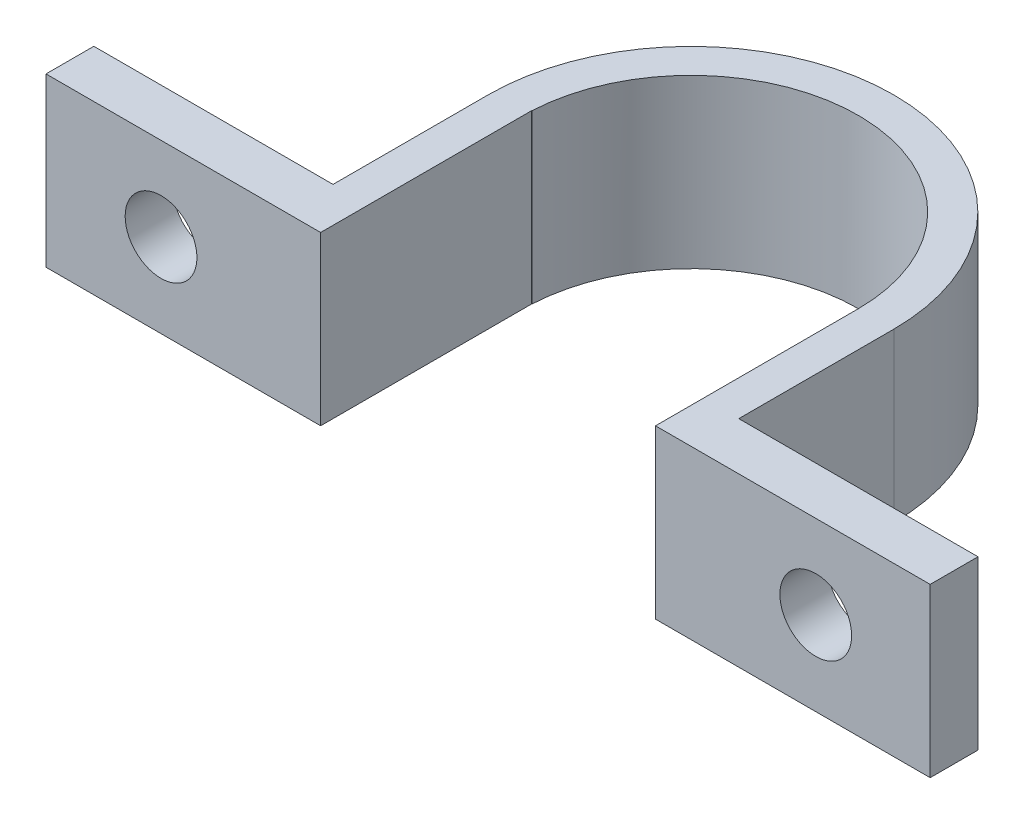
from build123d import *

# Parameters (mm, degrees)
EXTRUDE_1_DEPTH     = 7
SKETCH_2_R          = 7
CUT_EXTRUDE_1_DEPTH = 3
SKETCH_3_W          = 14
SKETCH_3_H          = 10.48148799
CUT_EXTRUDE_3_DEPTH = 3
SKETCH_4_R          = 7
SKETCH_4_W          = 13.991729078
SKETCH_4_H          = 10.821671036
CUT_EXTRUDE_4_DEPTH = 16
SKETCH_5_R          = 1.5
CUT_EXTRUDE_5_DEPTH = 16
SKETCH_6_W          = 10
SKETCH_6_H          = 2
EXTRUDE_2_DEPTH     = 7
CUT_EXTRUDE_START   = -7
SKETCH_7_R          = 1.5
CUT_EXTRUDE_6_DEPTH = 7
SKETCH_8_W          = 11.48148799
SKETCH_8_H          = 2
CUT_EXTRUDE_7_DEPTH = 10
SKETCH_9_W          = 5.87627962
SKETCH_9_H          = 7
CUT_EXTRUDE_8_DEPTH = 3


with BuildPart() as part:
    # Sketch 1 → Extrude 1 (new body)
    with BuildSketch(Plane(origin=(0, 0, 0), x_dir=(1, 0, 0), z_dir=(0, 1, 0))):
        with BuildLine():
            Line((8.48148799, -8.48148799), (8.48148799, 0))
            ThreePointArc((8.48148799, 0), (0, 8.48148799), (-8.48148799, 0))
            Line((-8.48148799, 0), (-8.48148799, -8.48148799))
            Line((-8.48148799, -8.48148799), (-18.48148799, -8.48148799))
            Line((-18.48148799, -8.48148799), (-18.48148799, -10.48148799))
            Line((-18.48148799, -10.48148799), (18.48148799, -10.48148799))
            Line((18.48148799, -10.48148799), (18.48148799, -8.48148799))
            Line((18.48148799, -8.48148799), (8.48148799, -8.48148799))
        make_face()
    extrude(amount=EXTRUDE_1_DEPTH)

    # Sketch 2 → Cut-Extrude 1 (cut)
    with BuildSketch(Plane(origin=(0, 7, 0), x_dir=(1, 0, 0), z_dir=(0, 1, 0))):
        with Locations(Location((0, 0, 0), (0, 0, 270))):
            Circle(SKETCH_2_R)
    extrude(amount=-CUT_EXTRUDE_1_DEPTH, mode=Mode.SUBTRACT)

    # Sketch 3 → Cut-Extrude 3 (cut)
    with BuildSketch(Plane(origin=(0, 7, 0), x_dir=(1, 0, 0), z_dir=(0, 1, 0))):
        with Locations((0, -5.240743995)):
            Rectangle(SKETCH_3_W, SKETCH_3_H)
    extrude(amount=-CUT_EXTRUDE_3_DEPTH, mode=Mode.SUBTRACT)

    # Sketch 4 → Cut-Extrude 4 (cut)
    with BuildSketch(Plane(origin=(0, 7, 0), x_dir=(1, 0, 0), z_dir=(0, 1, 0))):
        Circle(SKETCH_4_R)
        with Locations((-0.004135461, -5.070652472)):
            Rectangle(SKETCH_4_W, SKETCH_4_H)
    extrude(amount=-CUT_EXTRUDE_4_DEPTH, mode=Mode.SUBTRACT)

    # Sketch 5 → Cut-Extrude 5 (cut)
    with BuildSketch(Plane(origin=(0, 0, 8.48148799), x_dir=(-1, 0, 0), z_dir=(0, 0, -1))):
        with Locations((13.672545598, 3.5)):
            Circle(SKETCH_5_R)
        with Locations((-13.699354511, 3.5)):
            Circle(SKETCH_5_R)
    extrude(amount=-CUT_EXTRUDE_5_DEPTH, mode=Mode.SUBTRACT)

    # Sketch 6 → Extrude 2 (add)
    with BuildSketch(Plane(origin=(0, 7, 0), x_dir=(1, 0, 0), z_dir=(0, 1, 0))):
        with Locations((-13.48148799, -7.48148799)):
            Rectangle(SKETCH_6_W, SKETCH_6_H)
        with Locations((13.48148799, -7.48148799)):
            Rectangle(SKETCH_6_W, SKETCH_6_H)
    extrude(amount=-EXTRUDE_2_DEPTH)

    # Sketch 7 → Cut-Extrude 6 (cut)
    with BuildSketch(Plane.XY.offset(10.48148799).offset(CUT_EXTRUDE_START)):
        with Locations(Location((-13.672545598, 3.5, 0), (0, 0, 180))):
            Circle(SKETCH_7_R)
        with Locations(Location((13.699354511, 3.5, 0), (0, 0, 180))):
            Circle(SKETCH_7_R)
    extrude(amount=CUT_EXTRUDE_6_DEPTH, mode=Mode.SUBTRACT)

    # Sketch 8 → Cut-Extrude 7 (cut)
    with BuildSketch(Plane(origin=(0, 7, 0), x_dir=(1, 0, 0), z_dir=(0, 1, 0))):
        with Locations((-12.740743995, -9.48148799)):
            Rectangle(SKETCH_8_W, SKETCH_8_H)
        with Locations((12.740743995, -9.48148799)):
            Rectangle(SKETCH_8_W, SKETCH_8_H)
    extrude(amount=-CUT_EXTRUDE_7_DEPTH, mode=Mode.SUBTRACT)

    # Sketch 9 → Cut-Extrude 8 (cut)
    with BuildSketch(Plane.XY.offset(8.48148799)):
        with Locations((8.814315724, 3.5)):
            Rectangle(SKETCH_9_W, SKETCH_9_H)
    extrude(amount=CUT_EXTRUDE_8_DEPTH, mode=Mode.SUBTRACT)


solid = part.part
